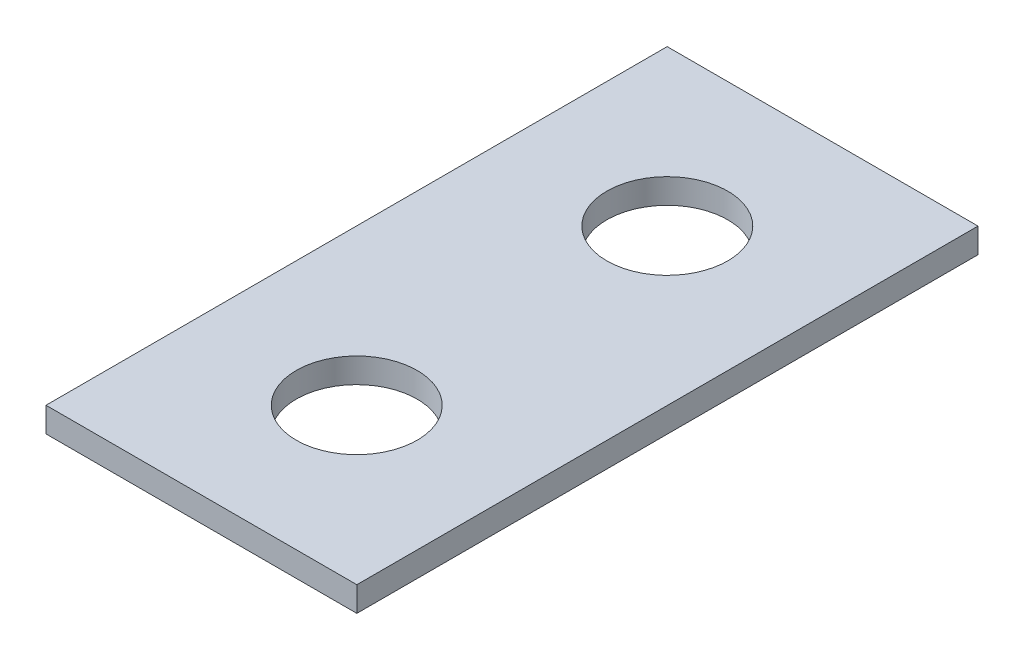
ISO-10303-21;
HEADER;
FILE_DESCRIPTION(('STEP AP214'),'2;1');
FILE_NAME('part.step','',(''),(''),'','','');
FILE_SCHEMA(('AUTOMOTIVE_DESIGN { 1 0 10303 214 1 1 1 1 }'));
ENDSEC;
DATA;
#1=APPLICATION_CONTEXT('core data for automotive mechanical design processes');
#2=APPLICATION_PROTOCOL_DEFINITION('international standard','automotive_design',2000,#1);
#3=PRODUCT_CONTEXT('',#1,'mechanical');
#4=PRODUCT('Part','Part','',(#3));
#5=PRODUCT_RELATED_PRODUCT_CATEGORY('part','',(#4));
#6=PRODUCT_DEFINITION_FORMATION('','',#4);
#7=PRODUCT_DEFINITION_CONTEXT('part definition',#1,'design');
#8=PRODUCT_DEFINITION('design','',#6,#7);
#9=PRODUCT_DEFINITION_SHAPE('','',#8);
#10=(LENGTH_UNIT() NAMED_UNIT(*) SI_UNIT(.MILLI.,.METRE.));
#11=(NAMED_UNIT(*) PLANE_ANGLE_UNIT() SI_UNIT($,.RADIAN.));
#12=(NAMED_UNIT(*) SI_UNIT($,.STERADIAN.) SOLID_ANGLE_UNIT());
#13=UNCERTAINTY_MEASURE_WITH_UNIT(LENGTH_MEASURE(1.E-05),#10,'distance_accuracy_value','');
#14=(GEOMETRIC_REPRESENTATION_CONTEXT(3) GLOBAL_UNCERTAINTY_ASSIGNED_CONTEXT((#13)) GLOBAL_UNIT_ASSIGNED_CONTEXT((#10,
#11,#12)) REPRESENTATION_CONTEXT('',''));
#15=CARTESIAN_POINT('',(0.,0.,0.));
#16=DIRECTION('',(0.,0.,1.));
#17=DIRECTION('',(1.,0.,0.));
#18=AXIS2_PLACEMENT_3D('',#15,#16,#17);
#19=CARTESIAN_POINT('',(4.76631,-0.762,9.525));
#20=DIRECTION('',(1.,0.,0.));
#21=DIRECTION('',(0.,0.,-1.));
#22=AXIS2_PLACEMENT_3D('',#19,#20,#21);
#23=PLANE('',#22);
#24=DIRECTION('',(0.,0.,-1.));
#25=VECTOR('',#24,1.);
#26=CARTESIAN_POINT('',(4.76631,0.,9.525));
#27=LINE('',#26,#25);
#28=CARTESIAN_POINT('',(4.76631,0.,9.525));
#29=VERTEX_POINT('',#28);
#30=CARTESIAN_POINT('',(4.76631,0.,-9.525));
#31=VERTEX_POINT('',#30);
#32=EDGE_CURVE('E102',#29,#31,#27,.T.);
#33=ORIENTED_EDGE('',*,*,#32,.F.);
#34=DIRECTION('',(0.,1.,0.));
#35=VECTOR('',#34,1.);
#36=CARTESIAN_POINT('',(4.76631,-0.762,9.525));
#37=LINE('',#36,#35);
#38=CARTESIAN_POINT('',(4.76631,-0.762,9.525));
#39=VERTEX_POINT('',#38);
#40=EDGE_CURVE('E11',#39,#29,#37,.T.);
#41=ORIENTED_EDGE('',*,*,#40,.F.);
#42=DIRECTION('',(0.,0.,-1.));
#43=VECTOR('',#42,1.);
#44=CARTESIAN_POINT('',(4.76631,-0.762,9.525));
#45=LINE('',#44,#43);
#46=CARTESIAN_POINT('',(4.76631,-0.762,-9.525));
#47=VERTEX_POINT('',#46);
#48=EDGE_CURVE('E95',#39,#47,#45,.T.);
#49=ORIENTED_EDGE('',*,*,#48,.T.);
#50=DIRECTION('',(0.,1.,0.));
#51=VECTOR('',#50,1.);
#52=CARTESIAN_POINT('',(4.76631,-0.762,-9.525));
#53=LINE('',#52,#51);
#54=EDGE_CURVE('E40',#47,#31,#53,.T.);
#55=ORIENTED_EDGE('',*,*,#54,.T.);
#56=EDGE_LOOP('',(#33,#41,#49,#55));
#57=FACE_BOUND('',#56,.T.);
#58=ADVANCED_FACE('F37',(#57),#23,.T.);
#59=CARTESIAN_POINT('',(-4.76631,-0.762,9.525));
#60=DIRECTION('',(0.,0.,1.));
#61=DIRECTION('',(1.,0.,0.));
#62=AXIS2_PLACEMENT_3D('',#59,#60,#61);
#63=PLANE('',#62);
#64=DIRECTION('',(1.,0.,0.));
#65=VECTOR('',#64,1.);
#66=CARTESIAN_POINT('',(-4.76631,0.,9.525));
#67=LINE('',#66,#65);
#68=CARTESIAN_POINT('',(-4.76631,0.,9.525));
#69=VERTEX_POINT('',#68);
#70=EDGE_CURVE('E97',#69,#29,#67,.T.);
#71=ORIENTED_EDGE('',*,*,#70,.F.);
#72=DIRECTION('',(0.,1.,0.));
#73=VECTOR('',#72,1.);
#74=CARTESIAN_POINT('',(-4.76631,-0.762,9.525));
#75=LINE('',#74,#73);
#76=CARTESIAN_POINT('',(-4.76631,-0.762,9.525));
#77=VERTEX_POINT('',#76);
#78=EDGE_CURVE('E46',#77,#69,#75,.T.);
#79=ORIENTED_EDGE('',*,*,#78,.F.);
#80=DIRECTION('',(1.,0.,0.));
#81=VECTOR('',#80,1.);
#82=CARTESIAN_POINT('',(-4.76631,-0.762,9.525));
#83=LINE('',#82,#81);
#84=EDGE_CURVE('E92',#77,#39,#83,.T.);
#85=ORIENTED_EDGE('',*,*,#84,.T.);
#86=ORIENTED_EDGE('',*,*,#40,.T.);
#87=EDGE_LOOP('',(#71,#79,#85,#86));
#88=FACE_BOUND('',#87,.T.);
#89=ADVANCED_FACE('F113',(#88),#63,.T.);
#90=CARTESIAN_POINT('',(-4.76631,-0.762,9.525));
#91=DIRECTION('',(-1.,0.,0.));
#92=DIRECTION('',(0.,0.,1.));
#93=AXIS2_PLACEMENT_3D('',#90,#91,#92);
#94=PLANE('',#93);
#95=DIRECTION('',(0.,0.,1.));
#96=VECTOR('',#95,1.);
#97=CARTESIAN_POINT('',(-4.76631,0.,9.525));
#98=LINE('',#97,#96);
#99=CARTESIAN_POINT('',(-4.76631,0.,-9.525));
#100=VERTEX_POINT('',#99);
#101=EDGE_CURVE('E87',#100,#69,#98,.T.);
#102=ORIENTED_EDGE('',*,*,#101,.F.);
#103=DIRECTION('',(0.,1.,0.));
#104=VECTOR('',#103,1.);
#105=CARTESIAN_POINT('',(-4.76631,-0.762,-9.525));
#106=LINE('',#105,#104);
#107=CARTESIAN_POINT('',(-4.76631,-0.762,-9.525));
#108=VERTEX_POINT('',#107);
#109=EDGE_CURVE('E82',#108,#100,#106,.T.);
#110=ORIENTED_EDGE('',*,*,#109,.F.);
#111=DIRECTION('',(0.,0.,1.));
#112=VECTOR('',#111,1.);
#113=CARTESIAN_POINT('',(-4.76631,-0.762,9.525));
#114=LINE('',#113,#112);
#115=EDGE_CURVE('E85',#108,#77,#114,.T.);
#116=ORIENTED_EDGE('',*,*,#115,.T.);
#117=ORIENTED_EDGE('',*,*,#78,.T.);
#118=EDGE_LOOP('',(#102,#110,#116,#117));
#119=FACE_BOUND('',#118,.T.);
#120=ADVANCED_FACE('F84',(#119),#94,.T.);
#121=CARTESIAN_POINT('',(-4.76631,-0.762,-9.525));
#122=DIRECTION('',(0.,0.,-1.));
#123=DIRECTION('',(-1.,0.,0.));
#124=AXIS2_PLACEMENT_3D('',#121,#122,#123);
#125=PLANE('',#124);
#126=DIRECTION('',(-1.,0.,0.));
#127=VECTOR('',#126,1.);
#128=CARTESIAN_POINT('',(-4.76631,0.,-9.525));
#129=LINE('',#128,#127);
#130=EDGE_CURVE('E105',#31,#100,#129,.T.);
#131=ORIENTED_EDGE('',*,*,#130,.F.);
#132=ORIENTED_EDGE('',*,*,#54,.F.);
#133=DIRECTION('',(-1.,0.,0.));
#134=VECTOR('',#133,1.);
#135=CARTESIAN_POINT('',(-4.76631,-0.762,-9.525));
#136=LINE('',#135,#134);
#137=EDGE_CURVE('E91',#47,#108,#136,.T.);
#138=ORIENTED_EDGE('',*,*,#137,.T.);
#139=ORIENTED_EDGE('',*,*,#109,.T.);
#140=EDGE_LOOP('',(#131,#132,#138,#139));
#141=FACE_BOUND('',#140,.T.);
#142=ADVANCED_FACE('F94',(#141),#125,.T.);
#143=CARTESIAN_POINT('',(0.,-0.762,0.));
#144=DIRECTION('',(0.,-1.,0.));
#145=DIRECTION('',(0.,0.,-1.));
#146=AXIS2_PLACEMENT_3D('',#143,#144,#145);
#147=PLANE('',#146);
#148=CARTESIAN_POINT('',(0.,-0.762,4.7625));
#149=DIRECTION('',(0.,1.,0.));
#150=DIRECTION('',(0.,0.,-1.));
#151=AXIS2_PLACEMENT_3D('',#148,#149,#150);
#152=CIRCLE('',#151,1.8542);
#153=CARTESIAN_POINT('',(0.,-0.762,6.6167));
#154=VERTEX_POINT('',#153);
#155=EDGE_CURVE('E146',#154,#154,#152,.T.);
#156=ORIENTED_EDGE('',*,*,#155,.T.);
#157=EDGE_LOOP('',(#156));
#158=FACE_BOUND('',#157,.T.);
#159=CARTESIAN_POINT('',(0.,-0.762,-4.7625));
#160=DIRECTION('',(0.,1.,0.));
#161=DIRECTION('',(0.,0.,1.));
#162=AXIS2_PLACEMENT_3D('',#159,#160,#161);
#163=CIRCLE('',#162,1.8542);
#164=CARTESIAN_POINT('',(0.,-0.762,-2.9083));
#165=VERTEX_POINT('',#164);
#166=EDGE_CURVE('E106',#165,#165,#163,.T.);
#167=ORIENTED_EDGE('',*,*,#166,.T.);
#168=EDGE_LOOP('',(#167));
#169=FACE_BOUND('',#168,.T.);
#170=ORIENTED_EDGE('',*,*,#48,.F.);
#171=ORIENTED_EDGE('',*,*,#84,.F.);
#172=ORIENTED_EDGE('',*,*,#115,.F.);
#173=ORIENTED_EDGE('',*,*,#137,.F.);
#174=EDGE_LOOP('',(#170,#171,#172,#173));
#175=FACE_BOUND('',#174,.T.);
#176=ADVANCED_FACE('F90',(#158,#169,#175),#147,.T.);
#177=CARTESIAN_POINT('',(0.,0.,0.));
#178=DIRECTION('',(0.,-1.,0.));
#179=DIRECTION('',(0.,0.,-1.));
#180=AXIS2_PLACEMENT_3D('',#177,#178,#179);
#181=PLANE('',#180);
#182=CARTESIAN_POINT('',(0.,0.,4.7625));
#183=DIRECTION('',(0.,1.,0.));
#184=DIRECTION('',(0.,0.,-1.));
#185=AXIS2_PLACEMENT_3D('',#182,#183,#184);
#186=CIRCLE('',#185,1.8542);
#187=CARTESIAN_POINT('',(0.,0.,6.6167));
#188=VERTEX_POINT('',#187);
#189=EDGE_CURVE('E149',#188,#188,#186,.T.);
#190=ORIENTED_EDGE('',*,*,#189,.F.);
#191=EDGE_LOOP('',(#190));
#192=FACE_BOUND('',#191,.T.);
#193=CARTESIAN_POINT('',(0.,0.,-4.7625));
#194=DIRECTION('',(0.,1.,0.));
#195=DIRECTION('',(0.,0.,1.));
#196=AXIS2_PLACEMENT_3D('',#193,#194,#195);
#197=CIRCLE('',#196,1.8542);
#198=CARTESIAN_POINT('',(0.,0.,-2.9083));
#199=VERTEX_POINT('',#198);
#200=EDGE_CURVE('E151',#199,#199,#197,.T.);
#201=ORIENTED_EDGE('',*,*,#200,.F.);
#202=EDGE_LOOP('',(#201));
#203=FACE_BOUND('',#202,.T.);
#204=ORIENTED_EDGE('',*,*,#32,.T.);
#205=ORIENTED_EDGE('',*,*,#130,.T.);
#206=ORIENTED_EDGE('',*,*,#101,.T.);
#207=ORIENTED_EDGE('',*,*,#70,.T.);
#208=EDGE_LOOP('',(#204,#205,#206,#207));
#209=FACE_BOUND('',#208,.T.);
#210=ADVANCED_FACE('F112',(#192,#203,#209),#181,.F.);
#211=CARTESIAN_POINT('',(0.,-0.762,-4.7625));
#212=DIRECTION('',(0.,1.,0.));
#213=DIRECTION('',(0.,0.,1.));
#214=AXIS2_PLACEMENT_3D('',#211,#212,#213);
#215=CYLINDRICAL_SURFACE('',#214,1.8542);
#216=CARTESIAN_POINT('',(0.,-0.762,-2.9083));
#217=CARTESIAN_POINT('',(0.,-0.7540625,-2.9083));
#218=CARTESIAN_POINT('',(0.,-0.746125,-2.9083));
#219=CARTESIAN_POINT('',(0.,-0.73025,-2.9083));
#220=CARTESIAN_POINT('',(0.,-0.7223125,-2.9083));
#221=CARTESIAN_POINT('',(0.,-0.7064375,-2.9083));
#222=CARTESIAN_POINT('',(0.,-0.6985,-2.9083));
#223=CARTESIAN_POINT('',(0.,-0.682625,-2.9083));
#224=CARTESIAN_POINT('',(0.,-0.6746875,-2.9083));
#225=CARTESIAN_POINT('',(0.,-0.6588125,-2.9083));
#226=CARTESIAN_POINT('',(0.,-0.650875,-2.9083));
#227=CARTESIAN_POINT('',(0.,-0.635,-2.9083));
#228=CARTESIAN_POINT('',(0.,-0.6270625,-2.9083));
#229=CARTESIAN_POINT('',(0.,-0.6111875,-2.9083));
#230=CARTESIAN_POINT('',(0.,-0.60325,-2.9083));
#231=CARTESIAN_POINT('',(0.,-0.587375,-2.9083));
#232=CARTESIAN_POINT('',(0.,-0.5794375,-2.9083));
#233=CARTESIAN_POINT('',(0.,-0.5635625,-2.9083));
#234=CARTESIAN_POINT('',(0.,-0.555625,-2.9083));
#235=CARTESIAN_POINT('',(0.,-0.53975,-2.9083));
#236=CARTESIAN_POINT('',(0.,-0.5318125,-2.9083));
#237=CARTESIAN_POINT('',(0.,-0.5159375,-2.9083));
#238=CARTESIAN_POINT('',(0.,-0.508,-2.9083));
#239=CARTESIAN_POINT('',(0.,-0.492125,-2.9083));
#240=CARTESIAN_POINT('',(0.,-0.4841875,-2.9083));
#241=CARTESIAN_POINT('',(0.,-0.4683125,-2.9083));
#242=CARTESIAN_POINT('',(0.,-0.460375,-2.9083));
#243=CARTESIAN_POINT('',(0.,-0.4445,-2.9083));
#244=CARTESIAN_POINT('',(0.,-0.4365625,-2.9083));
#245=CARTESIAN_POINT('',(0.,-0.4206875,-2.9083));
#246=CARTESIAN_POINT('',(0.,-0.41275,-2.9083));
#247=CARTESIAN_POINT('',(0.,-0.396875,-2.9083));
#248=CARTESIAN_POINT('',(0.,-0.3889375,-2.9083));
#249=CARTESIAN_POINT('',(0.,-0.3730625,-2.9083));
#250=CARTESIAN_POINT('',(0.,-0.365125,-2.9083));
#251=CARTESIAN_POINT('',(0.,-0.34925,-2.9083));
#252=CARTESIAN_POINT('',(0.,-0.3413125,-2.9083));
#253=CARTESIAN_POINT('',(0.,-0.3254375,-2.9083));
#254=CARTESIAN_POINT('',(0.,-0.3175,-2.9083));
#255=CARTESIAN_POINT('',(0.,-0.301625,-2.9083));
#256=CARTESIAN_POINT('',(0.,-0.2936875,-2.9083));
#257=CARTESIAN_POINT('',(0.,-0.2778125,-2.9083));
#258=CARTESIAN_POINT('',(0.,-0.269875,-2.9083));
#259=CARTESIAN_POINT('',(0.,-0.254,-2.9083));
#260=CARTESIAN_POINT('',(0.,-0.2460625,-2.9083));
#261=CARTESIAN_POINT('',(0.,-0.2301875,-2.9083));
#262=CARTESIAN_POINT('',(0.,-0.22225,-2.9083));
#263=CARTESIAN_POINT('',(0.,-0.206375,-2.9083));
#264=CARTESIAN_POINT('',(0.,-0.1984375,-2.9083));
#265=CARTESIAN_POINT('',(0.,-0.1825625,-2.9083));
#266=CARTESIAN_POINT('',(0.,-0.174625,-2.9083));
#267=CARTESIAN_POINT('',(0.,-0.15875,-2.9083));
#268=CARTESIAN_POINT('',(0.,-0.1508125,-2.9083));
#269=CARTESIAN_POINT('',(0.,-0.1349375,-2.9083));
#270=CARTESIAN_POINT('',(0.,-0.127,-2.9083));
#271=CARTESIAN_POINT('',(0.,-0.111125,-2.9083));
#272=CARTESIAN_POINT('',(0.,-0.1031875,-2.9083));
#273=CARTESIAN_POINT('',(0.,-0.0873125,-2.9083));
#274=CARTESIAN_POINT('',(0.,-0.079375,-2.9083));
#275=CARTESIAN_POINT('',(0.,-0.0635,-2.9083));
#276=CARTESIAN_POINT('',(0.,-0.0555625,-2.9083));
#277=CARTESIAN_POINT('',(0.,-0.0396875,-2.9083));
#278=CARTESIAN_POINT('',(0.,-0.03175,-2.9083));
#279=CARTESIAN_POINT('',(0.,-0.015875,-2.9083));
#280=CARTESIAN_POINT('',(0.,-0.00793749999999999,-2.9083));
#281=CARTESIAN_POINT('',(0.,0.,-2.9083));
#282=B_SPLINE_CURVE_WITH_KNOTS('',3,(#216,#217,#218,#219,#220,#221,#222,#223,#224,#225,#226,
#227,#228,#229,#230,#231,#232,#233,#234,#235,#236,#237,#238,#239,#240,#241,#242,#243,#244,#245,
#246,#247,#248,#249,#250,#251,#252,#253,#254,#255,#256,#257,#258,#259,#260,#261,#262,#263,#264,
#265,#266,#267,#268,#269,#270,#271,#272,#273,#274,#275,#276,#277,#278,#279,#280,#281),
.UNSPECIFIED.,.F.,.F.,(4,2,2,2,2,2,2,2,2,2,2,2,2,2,2,2,2,2,2,2,2,2,2,2,2,2,2,2,2,2,2,2,4),(0.,
0.0238125,0.0476249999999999,0.0714375,0.09525,0.1190625,0.142875,0.1666875,0.1905,0.2143125,
0.238125,0.2619375,0.28575,0.3095625,0.333375,0.3571875,0.381,0.4048125,0.428625,0.4524375,
0.47625,0.5000625,0.523875,0.5476875,0.5715,0.5953125,0.619125,0.6429375,0.66675,0.6905625,
0.714375,0.7381875,0.762),.UNSPECIFIED.);
#283=EDGE_CURVE('BSEAM131',#165,#199,#282,.T.);
#284=ORIENTED_EDGE('',*,*,#166,.F.);
#285=ORIENTED_EDGE('',*,*,#200,.T.);
#286=ORIENTED_EDGE('',*,*,#283,.T.);
#287=ORIENTED_EDGE('',*,*,#283,.F.);
#288=EDGE_LOOP('',(#284,#286,#285,#287));
#289=FACE_BOUND('',#288,.T.);
#290=ADVANCED_FACE('F131',(#289),#215,.F.);
#291=CARTESIAN_POINT('',(0.,-0.762,4.7625));
#292=DIRECTION('',(0.,1.,0.));
#293=DIRECTION('',(0.,0.,1.));
#294=AXIS2_PLACEMENT_3D('',#291,#292,#293);
#295=CYLINDRICAL_SURFACE('',#294,1.8542);
#296=CARTESIAN_POINT('',(0.,-0.762,6.6167));
#297=CARTESIAN_POINT('',(0.,-0.7540625,6.6167));
#298=CARTESIAN_POINT('',(0.,-0.746125,6.6167));
#299=CARTESIAN_POINT('',(0.,-0.73025,6.6167));
#300=CARTESIAN_POINT('',(0.,-0.7223125,6.6167));
#301=CARTESIAN_POINT('',(0.,-0.7064375,6.6167));
#302=CARTESIAN_POINT('',(0.,-0.6985,6.6167));
#303=CARTESIAN_POINT('',(0.,-0.682625,6.6167));
#304=CARTESIAN_POINT('',(0.,-0.6746875,6.6167));
#305=CARTESIAN_POINT('',(0.,-0.6588125,6.6167));
#306=CARTESIAN_POINT('',(0.,-0.650875,6.6167));
#307=CARTESIAN_POINT('',(0.,-0.635,6.6167));
#308=CARTESIAN_POINT('',(0.,-0.6270625,6.6167));
#309=CARTESIAN_POINT('',(0.,-0.6111875,6.6167));
#310=CARTESIAN_POINT('',(0.,-0.60325,6.6167));
#311=CARTESIAN_POINT('',(0.,-0.587375,6.6167));
#312=CARTESIAN_POINT('',(0.,-0.5794375,6.6167));
#313=CARTESIAN_POINT('',(0.,-0.5635625,6.6167));
#314=CARTESIAN_POINT('',(0.,-0.555625,6.6167));
#315=CARTESIAN_POINT('',(0.,-0.53975,6.6167));
#316=CARTESIAN_POINT('',(0.,-0.5318125,6.6167));
#317=CARTESIAN_POINT('',(0.,-0.5159375,6.6167));
#318=CARTESIAN_POINT('',(0.,-0.508,6.6167));
#319=CARTESIAN_POINT('',(0.,-0.492125,6.6167));
#320=CARTESIAN_POINT('',(0.,-0.4841875,6.6167));
#321=CARTESIAN_POINT('',(0.,-0.4683125,6.6167));
#322=CARTESIAN_POINT('',(0.,-0.460375,6.6167));
#323=CARTESIAN_POINT('',(0.,-0.4445,6.6167));
#324=CARTESIAN_POINT('',(0.,-0.4365625,6.6167));
#325=CARTESIAN_POINT('',(0.,-0.4206875,6.6167));
#326=CARTESIAN_POINT('',(0.,-0.41275,6.6167));
#327=CARTESIAN_POINT('',(0.,-0.396875,6.6167));
#328=CARTESIAN_POINT('',(0.,-0.3889375,6.6167));
#329=CARTESIAN_POINT('',(0.,-0.3730625,6.6167));
#330=CARTESIAN_POINT('',(0.,-0.365125,6.6167));
#331=CARTESIAN_POINT('',(0.,-0.34925,6.6167));
#332=CARTESIAN_POINT('',(0.,-0.3413125,6.6167));
#333=CARTESIAN_POINT('',(0.,-0.3254375,6.6167));
#334=CARTESIAN_POINT('',(0.,-0.3175,6.6167));
#335=CARTESIAN_POINT('',(0.,-0.301625,6.6167));
#336=CARTESIAN_POINT('',(0.,-0.2936875,6.6167));
#337=CARTESIAN_POINT('',(0.,-0.2778125,6.6167));
#338=CARTESIAN_POINT('',(0.,-0.269875,6.6167));
#339=CARTESIAN_POINT('',(0.,-0.254,6.6167));
#340=CARTESIAN_POINT('',(0.,-0.2460625,6.6167));
#341=CARTESIAN_POINT('',(0.,-0.2301875,6.6167));
#342=CARTESIAN_POINT('',(0.,-0.22225,6.6167));
#343=CARTESIAN_POINT('',(0.,-0.206375,6.6167));
#344=CARTESIAN_POINT('',(0.,-0.1984375,6.6167));
#345=CARTESIAN_POINT('',(0.,-0.1825625,6.6167));
#346=CARTESIAN_POINT('',(0.,-0.174625,6.6167));
#347=CARTESIAN_POINT('',(0.,-0.15875,6.6167));
#348=CARTESIAN_POINT('',(0.,-0.1508125,6.6167));
#349=CARTESIAN_POINT('',(0.,-0.1349375,6.6167));
#350=CARTESIAN_POINT('',(0.,-0.127,6.6167));
#351=CARTESIAN_POINT('',(0.,-0.111125,6.6167));
#352=CARTESIAN_POINT('',(0.,-0.1031875,6.6167));
#353=CARTESIAN_POINT('',(0.,-0.0873125,6.6167));
#354=CARTESIAN_POINT('',(0.,-0.079375,6.6167));
#355=CARTESIAN_POINT('',(0.,-0.0635,6.6167));
#356=CARTESIAN_POINT('',(0.,-0.0555625,6.6167));
#357=CARTESIAN_POINT('',(0.,-0.0396875,6.6167));
#358=CARTESIAN_POINT('',(0.,-0.03175,6.6167));
#359=CARTESIAN_POINT('',(0.,-0.015875,6.6167));
#360=CARTESIAN_POINT('',(0.,-0.00793749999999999,6.6167));
#361=CARTESIAN_POINT('',(0.,0.,6.6167));
#362=B_SPLINE_CURVE_WITH_KNOTS('',3,(#296,#297,#298,#299,#300,#301,#302,#303,#304,#305,#306,
#307,#308,#309,#310,#311,#312,#313,#314,#315,#316,#317,#318,#319,#320,#321,#322,#323,#324,#325,
#326,#327,#328,#329,#330,#331,#332,#333,#334,#335,#336,#337,#338,#339,#340,#341,#342,#343,#344,
#345,#346,#347,#348,#349,#350,#351,#352,#353,#354,#355,#356,#357,#358,#359,#360,#361),
.UNSPECIFIED.,.F.,.F.,(4,2,2,2,2,2,2,2,2,2,2,2,2,2,2,2,2,2,2,2,2,2,2,2,2,2,2,2,2,2,2,2,4),(0.,
0.0238125,0.0476249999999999,0.0714375,0.09525,0.1190625,0.142875,0.1666875,0.1905,0.2143125,
0.238125,0.2619375,0.28575,0.3095625,0.333375,0.3571875,0.381,0.4048125,0.428625,0.4524375,
0.47625,0.5000625,0.523875,0.5476875,0.5715,0.5953125,0.619125,0.6429375,0.66675,0.6905625,
0.714375,0.7381875,0.762),.UNSPECIFIED.);
#363=EDGE_CURVE('BSEAM138',#154,#188,#362,.T.);
#364=ORIENTED_EDGE('',*,*,#155,.F.);
#365=ORIENTED_EDGE('',*,*,#189,.T.);
#366=ORIENTED_EDGE('',*,*,#363,.T.);
#367=ORIENTED_EDGE('',*,*,#363,.F.);
#368=EDGE_LOOP('',(#364,#366,#365,#367));
#369=FACE_BOUND('',#368,.T.);
#370=ADVANCED_FACE('F138',(#369),#295,.F.);
#371=CLOSED_SHELL('',(#58,#89,#120,#142,#176,#210,#290,#370));
#372=MANIFOLD_SOLID_BREP('B2',#371);
#373=ADVANCED_BREP_SHAPE_REPRESENTATION('',(#18,#372),#14);
#374=SHAPE_DEFINITION_REPRESENTATION(#9,#373);
ENDSEC;
END-ISO-10303-21;
